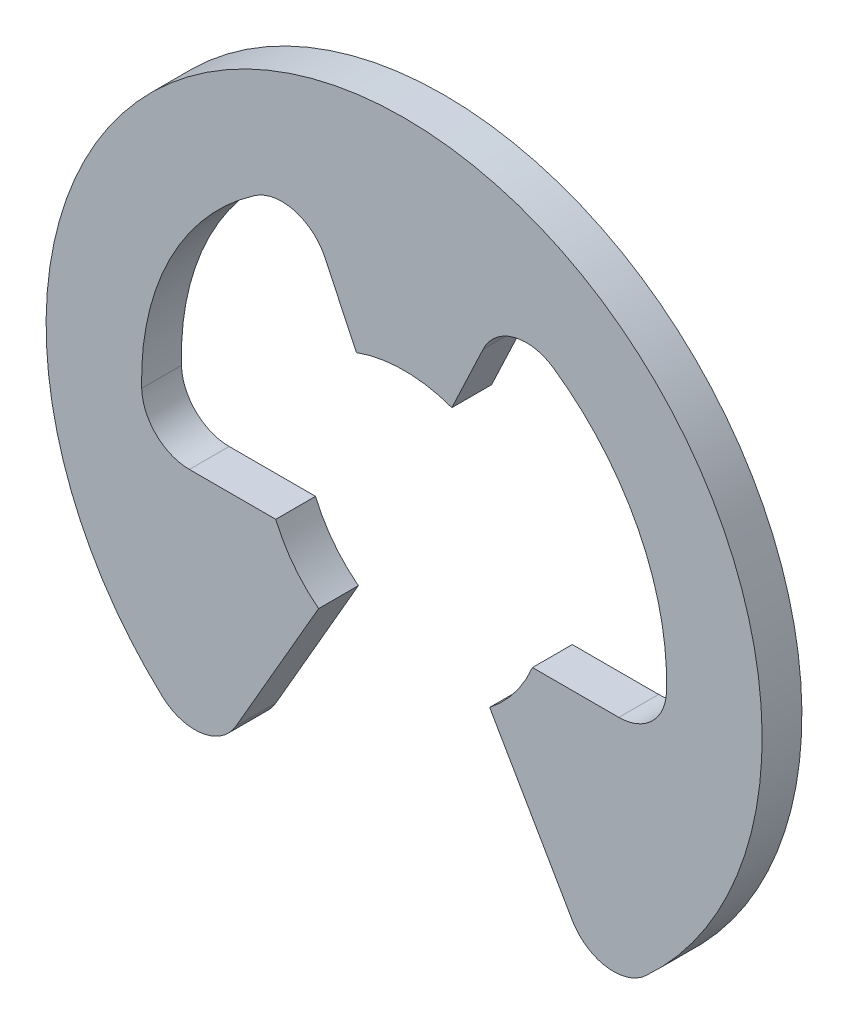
from build123d import *

# Parameters (mm, degrees)
BASE_EXTRUSION_DEPTH = 0.5


with BuildPart() as part:
    # Esquisse1 → Base-Extrusion (new body)
    with BuildSketch(Plane(origin=(0, 0, -0.5), x_dir=(-1, 0, 0), z_dir=(0, 0, -1))):
        with BuildLine():
            Line((-1.664761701, 2.79974434), (-1.271741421, 1.966855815))
            ThreePointArc((-1.271741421, 1.966855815), (-0.671741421, 2.072927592), (-0.071741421, 1.966855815))
            Line((-0.071741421, 1.966855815), (0.321278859, 2.79974434))
            ThreePointArc((0.321278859, 2.79974434), (0.708230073, 3.123147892), (1.205154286, 3.037197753))
            ThreePointArc((1.205154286, 3.037197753), (2.272673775, 1.813034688), (2.626889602, 0.227883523))
            ThreePointArc((2.626889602, 0.227883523), (2.445248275, -0.1851661), (2.027138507, -0.354835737))
            Line((2.027138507, -0.354835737), (0.941682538, -0.354835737))
            ThreePointArc((0.941682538, -0.354835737), (0.71772812, -0.740968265), (0.403371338, -1.057881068))
            Line((0.403371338, -1.057881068), (1.440843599, -2.854835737))
            ThreePointArc((1.440843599, -2.854835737), (1.86891666, -3.147811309), (2.365412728, -2.997568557))
            ThreePointArc((2.365412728, -2.997568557), (-0.671741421, 4.822927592), (-3.70889557, -2.997568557))
            ThreePointArc((-3.70889557, -2.997568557), (-3.212399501, -3.147811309), (-2.784326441, -2.854835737))
            Line((-2.784326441, -2.854835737), (-1.746854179, -1.057881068))
            ThreePointArc((-1.746854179, -1.057881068), (-2.061210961, -0.740968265), (-2.285165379, -0.354835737))
            Line((-2.285165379, -0.354835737), (-3.370621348, -0.354835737))
            ThreePointArc((-3.370621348, -0.354835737), (-3.788731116, -0.1851661), (-3.970372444, 0.227883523))
            ThreePointArc((-3.970372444, 0.227883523), (-3.616156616, 1.813034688), (-2.548637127, 3.037197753))
            ThreePointArc((-2.548637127, 3.037197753), (-2.051712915, 3.123147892), (-1.664761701, 2.79974434))
        make_face()
    extrude(amount=-BASE_EXTRUSION_DEPTH)


solid = part.part
